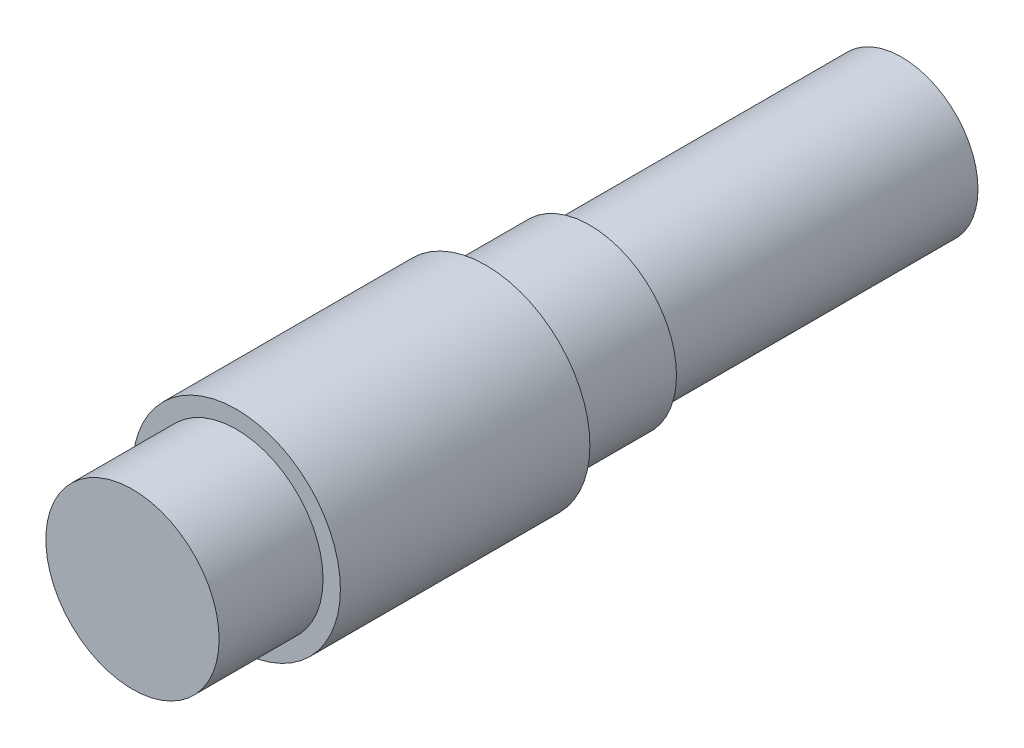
ISO-10303-21;
HEADER;
FILE_DESCRIPTION(('STEP AP214'),'2;1');
FILE_NAME('part.step','',(''),(''),'','','');
FILE_SCHEMA(('AUTOMOTIVE_DESIGN { 1 0 10303 214 1 1 1 1 }'));
ENDSEC;
DATA;
#1=APPLICATION_CONTEXT('core data for automotive mechanical design processes');
#2=APPLICATION_PROTOCOL_DEFINITION('international standard','automotive_design',2000,#1);
#3=PRODUCT_CONTEXT('',#1,'mechanical');
#4=PRODUCT('Part','Part','',(#3));
#5=PRODUCT_RELATED_PRODUCT_CATEGORY('part','',(#4));
#6=PRODUCT_DEFINITION_FORMATION('','',#4);
#7=PRODUCT_DEFINITION_CONTEXT('part definition',#1,'design');
#8=PRODUCT_DEFINITION('design','',#6,#7);
#9=PRODUCT_DEFINITION_SHAPE('','',#8);
#10=(LENGTH_UNIT() NAMED_UNIT(*) SI_UNIT(.MILLI.,.METRE.));
#11=(NAMED_UNIT(*) PLANE_ANGLE_UNIT() SI_UNIT($,.RADIAN.));
#12=(NAMED_UNIT(*) SI_UNIT($,.STERADIAN.) SOLID_ANGLE_UNIT());
#13=UNCERTAINTY_MEASURE_WITH_UNIT(LENGTH_MEASURE(1.E-05),#10,'distance_accuracy_value','');
#14=(GEOMETRIC_REPRESENTATION_CONTEXT(3) GLOBAL_UNCERTAINTY_ASSIGNED_CONTEXT((#13)) GLOBAL_UNIT_ASSIGNED_CONTEXT((#10,
#11,#12)) REPRESENTATION_CONTEXT('',''));
#15=CARTESIAN_POINT('',(0.,0.,0.));
#16=DIRECTION('',(0.,0.,1.));
#17=DIRECTION('',(1.,0.,0.));
#18=AXIS2_PLACEMENT_3D('',#15,#16,#17);
#19=CARTESIAN_POINT('',(0.,0.,18.));
#20=DIRECTION('',(0.,0.,-1.));
#21=DIRECTION('',(-1.,0.,0.));
#22=AXIS2_PLACEMENT_3D('',#19,#20,#21);
#23=CYLINDRICAL_SURFACE('',#22,15.);
#24=CARTESIAN_POINT('',(0.,0.,18.));
#25=DIRECTION('',(0.,0.,1.));
#26=DIRECTION('',(1.,0.,0.));
#27=AXIS2_PLACEMENT_3D('',#24,#25,#26);
#28=CIRCLE('',#27,15.);
#29=CARTESIAN_POINT('',(15.,0.,18.));
#30=VERTEX_POINT('',#29);
#31=EDGE_CURVE('E48',#30,#30,#28,.T.);
#32=ORIENTED_EDGE('',*,*,#31,.F.);
#33=EDGE_LOOP('',(#32));
#34=FACE_BOUND('',#33,.T.);
#35=CARTESIAN_POINT('',(0.,0.,-18.));
#36=DIRECTION('',(0.,0.,1.));
#37=DIRECTION('',(1.,0.,0.));
#38=AXIS2_PLACEMENT_3D('',#35,#36,#37);
#39=CIRCLE('',#38,15.);
#40=CARTESIAN_POINT('',(15.,0.,-18.));
#41=VERTEX_POINT('',#40);
#42=EDGE_CURVE('E52',#41,#41,#39,.T.);
#43=ORIENTED_EDGE('',*,*,#42,.T.);
#44=EDGE_LOOP('',(#43));
#45=FACE_BOUND('',#44,.T.);
#46=ADVANCED_FACE('F41',(#34,#45),#23,.T.);
#47=CARTESIAN_POINT('',(0.,0.,18.));
#48=DIRECTION('',(0.,0.,1.));
#49=DIRECTION('',(1.,0.,0.));
#50=AXIS2_PLACEMENT_3D('',#47,#48,#49);
#51=PLANE('',#50);
#52=CARTESIAN_POINT('',(0.,0.,18.));
#53=DIRECTION('',(0.,0.,1.));
#54=DIRECTION('',(1.,0.,0.));
#55=AXIS2_PLACEMENT_3D('',#52,#53,#54);
#56=CIRCLE('',#55,12.5);
#57=CARTESIAN_POINT('',(12.5,0.,18.));
#58=VERTEX_POINT('',#57);
#59=EDGE_CURVE('E56',#58,#58,#56,.F.);
#60=ORIENTED_EDGE('',*,*,#59,.T.);
#61=EDGE_LOOP('',(#60));
#62=FACE_BOUND('',#61,.T.);
#63=ORIENTED_EDGE('',*,*,#31,.T.);
#64=EDGE_LOOP('',(#63));
#65=FACE_BOUND('',#64,.T.);
#66=ADVANCED_FACE('F92',(#62,#65),#51,.T.);
#67=CARTESIAN_POINT('',(0.,0.,-18.));
#68=DIRECTION('',(0.,0.,1.));
#69=DIRECTION('',(1.,0.,0.));
#70=AXIS2_PLACEMENT_3D('',#67,#68,#69);
#71=PLANE('',#70);
#72=CARTESIAN_POINT('',(0.,0.,-18.));
#73=DIRECTION('',(0.,0.,1.));
#74=DIRECTION('',(1.,0.,0.));
#75=AXIS2_PLACEMENT_3D('',#72,#73,#74);
#76=CIRCLE('',#75,12.5);
#77=CARTESIAN_POINT('',(12.5,0.,-18.));
#78=VERTEX_POINT('',#77);
#79=EDGE_CURVE('E10',#78,#78,#76,.F.);
#80=ORIENTED_EDGE('',*,*,#79,.F.);
#81=EDGE_LOOP('',(#80));
#82=FACE_BOUND('',#81,.T.);
#83=ORIENTED_EDGE('',*,*,#42,.F.);
#84=EDGE_LOOP('',(#83));
#85=FACE_BOUND('',#84,.T.);
#86=ADVANCED_FACE('F97',(#82,#85),#71,.F.);
#87=CARTESIAN_POINT('',(0.,0.,-33.));
#88=DIRECTION('',(0.,0.,1.));
#89=DIRECTION('',(1.,0.,0.));
#90=AXIS2_PLACEMENT_3D('',#87,#88,#89);
#91=PLANE('',#90);
#92=CARTESIAN_POINT('',(0.,0.,-33.));
#93=DIRECTION('',(0.,0.,1.));
#94=DIRECTION('',(1.,0.,0.));
#95=AXIS2_PLACEMENT_3D('',#92,#93,#94);
#96=CIRCLE('',#95,11.);
#97=CARTESIAN_POINT('',(11.,0.,-33.));
#98=VERTEX_POINT('',#97);
#99=EDGE_CURVE('E44',#98,#98,#96,.T.);
#100=ORIENTED_EDGE('',*,*,#99,.T.);
#101=EDGE_LOOP('',(#100));
#102=FACE_BOUND('',#101,.T.);
#103=CARTESIAN_POINT('',(0.,0.,-33.));
#104=DIRECTION('',(0.,0.,1.));
#105=DIRECTION('',(1.,0.,0.));
#106=AXIS2_PLACEMENT_3D('',#103,#104,#105);
#107=CIRCLE('',#106,12.5);
#108=CARTESIAN_POINT('',(12.5,0.,-33.));
#109=VERTEX_POINT('',#108);
#110=EDGE_CURVE('E61',#109,#109,#107,.T.);
#111=ORIENTED_EDGE('',*,*,#110,.F.);
#112=EDGE_LOOP('',(#111));
#113=FACE_BOUND('',#112,.T.);
#114=ADVANCED_FACE('F73',(#102,#113),#91,.F.);
#115=CARTESIAN_POINT('',(0.,0.,33.));
#116=DIRECTION('',(0.,0.,-1.));
#117=DIRECTION('',(-1.,0.,0.));
#118=AXIS2_PLACEMENT_3D('',#115,#116,#117);
#119=CYLINDRICAL_SURFACE('',#118,12.5);
#120=ORIENTED_EDGE('',*,*,#110,.T.);
#121=EDGE_LOOP('',(#120));
#122=FACE_BOUND('',#121,.T.);
#123=ORIENTED_EDGE('',*,*,#79,.T.);
#124=EDGE_LOOP('',(#123));
#125=FACE_BOUND('',#124,.T.);
#126=ADVANCED_FACE('F109',(#122,#125),#119,.T.);
#127=ORIENTED_EDGE('',*,*,#59,.F.);
#128=EDGE_LOOP('',(#127));
#129=FACE_BOUND('',#128,.T.);
#130=CARTESIAN_POINT('',(0.,0.,33.));
#131=DIRECTION('',(0.,0.,1.));
#132=DIRECTION('',(1.,0.,0.));
#133=AXIS2_PLACEMENT_3D('',#130,#131,#132);
#134=CIRCLE('',#133,12.5);
#135=CARTESIAN_POINT('',(12.5,0.,33.));
#136=VERTEX_POINT('',#135);
#137=EDGE_CURVE('E60',#136,#136,#134,.T.);
#138=ORIENTED_EDGE('',*,*,#137,.F.);
#139=EDGE_LOOP('',(#138));
#140=FACE_BOUND('',#139,.T.);
#141=ADVANCED_FACE('F88',(#129,#140),#119,.T.);
#142=CARTESIAN_POINT('',(0.,0.,33.));
#143=DIRECTION('',(0.,0.,1.));
#144=DIRECTION('',(1.,0.,0.));
#145=AXIS2_PLACEMENT_3D('',#142,#143,#144);
#146=PLANE('',#145);
#147=ORIENTED_EDGE('',*,*,#137,.T.);
#148=EDGE_LOOP('',(#147));
#149=FACE_BOUND('',#148,.T.);
#150=ADVANCED_FACE('F79',(#149),#146,.T.);
#151=CARTESIAN_POINT('',(0.,0.,-78.));
#152=DIRECTION('',(0.,0.,1.));
#153=DIRECTION('',(1.,0.,0.));
#154=AXIS2_PLACEMENT_3D('',#151,#152,#153);
#155=CYLINDRICAL_SURFACE('',#154,11.);
#156=CARTESIAN_POINT('',(0.,0.,-78.));
#157=DIRECTION('',(0.,0.,1.));
#158=DIRECTION('',(1.,0.,0.));
#159=AXIS2_PLACEMENT_3D('',#156,#157,#158);
#160=CIRCLE('',#159,11.);
#161=CARTESIAN_POINT('',(11.,0.,-78.));
#162=VERTEX_POINT('',#161);
#163=EDGE_CURVE('E66',#162,#162,#160,.T.);
#164=ORIENTED_EDGE('',*,*,#163,.T.);
#165=EDGE_LOOP('',(#164));
#166=FACE_BOUND('',#165,.T.);
#167=ORIENTED_EDGE('',*,*,#99,.F.);
#168=EDGE_LOOP('',(#167));
#169=FACE_BOUND('',#168,.T.);
#170=ADVANCED_FACE('F76',(#166,#169),#155,.T.);
#171=CARTESIAN_POINT('',(0.,0.,-78.));
#172=DIRECTION('',(0.,0.,1.));
#173=DIRECTION('',(1.,0.,0.));
#174=AXIS2_PLACEMENT_3D('',#171,#172,#173);
#175=PLANE('',#174);
#176=ORIENTED_EDGE('',*,*,#163,.F.);
#177=EDGE_LOOP('',(#176));
#178=FACE_BOUND('',#177,.T.);
#179=ADVANCED_FACE('F78',(#178),#175,.F.);
#180=CLOSED_SHELL('',(#46,#66,#86,#114,#126,#141,#150,#170,#179));
#181=MANIFOLD_SOLID_BREP('B2',#180);
#182=ADVANCED_BREP_SHAPE_REPRESENTATION('',(#18,#181),#14);
#183=SHAPE_DEFINITION_REPRESENTATION(#9,#182);
ENDSEC;
END-ISO-10303-21;
